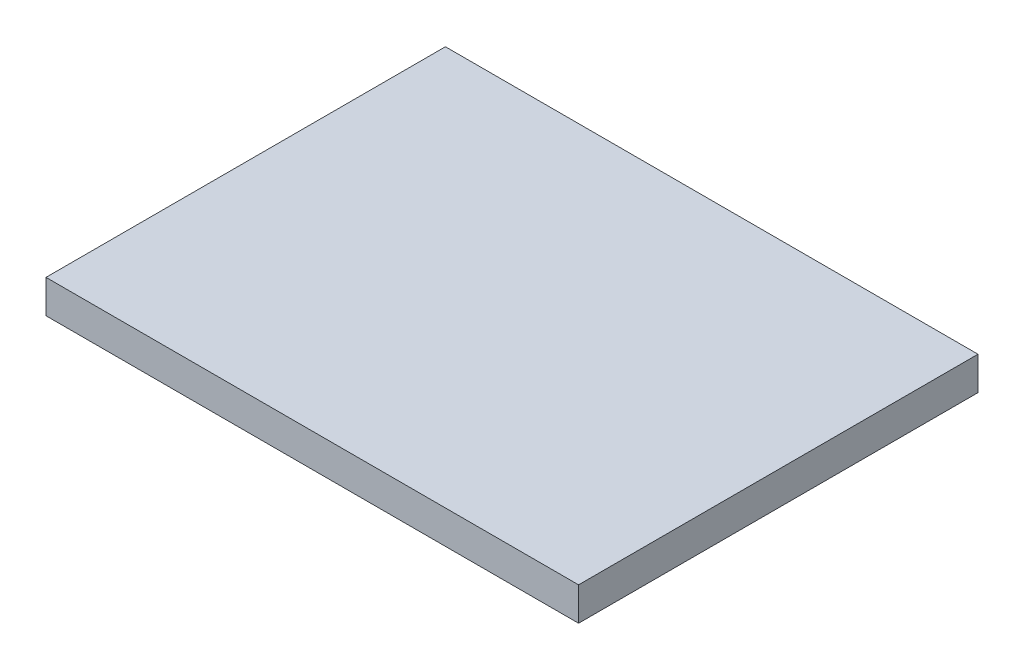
ISO-10303-21;
HEADER;
FILE_DESCRIPTION(('STEP AP214'),'2;1');
FILE_NAME('part.step','',(''),(''),'','','');
FILE_SCHEMA(('AUTOMOTIVE_DESIGN { 1 0 10303 214 1 1 1 1 }'));
ENDSEC;
DATA;
#1=APPLICATION_CONTEXT('core data for automotive mechanical design processes');
#2=APPLICATION_PROTOCOL_DEFINITION('international standard','automotive_design',2000,#1);
#3=PRODUCT_CONTEXT('',#1,'mechanical');
#4=PRODUCT('Part','Part','',(#3));
#5=PRODUCT_RELATED_PRODUCT_CATEGORY('part','',(#4));
#6=PRODUCT_DEFINITION_FORMATION('','',#4);
#7=PRODUCT_DEFINITION_CONTEXT('part definition',#1,'design');
#8=PRODUCT_DEFINITION('design','',#6,#7);
#9=PRODUCT_DEFINITION_SHAPE('','',#8);
#10=(LENGTH_UNIT() NAMED_UNIT(*) SI_UNIT(.MILLI.,.METRE.));
#11=(NAMED_UNIT(*) PLANE_ANGLE_UNIT() SI_UNIT($,.RADIAN.));
#12=(NAMED_UNIT(*) SI_UNIT($,.STERADIAN.) SOLID_ANGLE_UNIT());
#13=UNCERTAINTY_MEASURE_WITH_UNIT(LENGTH_MEASURE(1.E-05),#10,'distance_accuracy_value','');
#14=(GEOMETRIC_REPRESENTATION_CONTEXT(3) GLOBAL_UNCERTAINTY_ASSIGNED_CONTEXT((#13)) GLOBAL_UNIT_ASSIGNED_CONTEXT((#10,
#11,#12)) REPRESENTATION_CONTEXT('',''));
#15=CARTESIAN_POINT('',(0.,0.,0.));
#16=DIRECTION('',(0.,0.,1.));
#17=DIRECTION('',(1.,0.,0.));
#18=AXIS2_PLACEMENT_3D('',#15,#16,#17);
#19=CARTESIAN_POINT('',(-152.4,19.05,-152.4));
#20=DIRECTION('',(1.,0.,0.));
#21=DIRECTION('',(0.,0.,-1.));
#22=AXIS2_PLACEMENT_3D('',#19,#20,#21);
#23=PLANE('',#22);
#24=DIRECTION('',(0.,0.,1.));
#25=VECTOR('',#24,1.);
#26=CARTESIAN_POINT('',(-152.4,0.,-152.4));
#27=LINE('',#26,#25);
#28=CARTESIAN_POINT('',(-152.4,0.,-152.4));
#29=VERTEX_POINT('',#28);
#30=CARTESIAN_POINT('',(-152.4,0.,76.2));
#31=VERTEX_POINT('',#30);
#32=EDGE_CURVE('E95',#29,#31,#27,.T.);
#33=ORIENTED_EDGE('',*,*,#32,.T.);
#34=DIRECTION('',(0.,-1.,0.));
#35=VECTOR('',#34,1.);
#36=CARTESIAN_POINT('',(-152.4,19.05,76.2));
#37=LINE('',#36,#35);
#38=CARTESIAN_POINT('',(-152.4,19.05,76.2));
#39=VERTEX_POINT('',#38);
#40=EDGE_CURVE('E11',#39,#31,#37,.T.);
#41=ORIENTED_EDGE('',*,*,#40,.F.);
#42=DIRECTION('',(0.,0.,1.));
#43=VECTOR('',#42,1.);
#44=CARTESIAN_POINT('',(-152.4,19.05,-152.4));
#45=LINE('',#44,#43);
#46=CARTESIAN_POINT('',(-152.4,19.05,-152.4));
#47=VERTEX_POINT('',#46);
#48=EDGE_CURVE('E83',#47,#39,#45,.T.);
#49=ORIENTED_EDGE('',*,*,#48,.F.);
#50=DIRECTION('',(0.,-1.,0.));
#51=VECTOR('',#50,1.);
#52=CARTESIAN_POINT('',(-152.4,19.05,-152.4));
#53=LINE('',#52,#51);
#54=EDGE_CURVE('E91',#47,#29,#53,.T.);
#55=ORIENTED_EDGE('',*,*,#54,.T.);
#56=EDGE_LOOP('',(#33,#41,#49,#55));
#57=FACE_BOUND('',#56,.T.);
#58=ADVANCED_FACE('F32',(#57),#23,.F.);
#59=CARTESIAN_POINT('',(-152.4,19.05,76.2));
#60=DIRECTION('',(0.,0.,-1.));
#61=DIRECTION('',(-1.,0.,0.));
#62=AXIS2_PLACEMENT_3D('',#59,#60,#61);
#63=PLANE('',#62);
#64=DIRECTION('',(1.,0.,0.));
#65=VECTOR('',#64,1.);
#66=CARTESIAN_POINT('',(-152.4,0.,76.2));
#67=LINE('',#66,#65);
#68=CARTESIAN_POINT('',(152.4,0.,76.2));
#69=VERTEX_POINT('',#68);
#70=EDGE_CURVE('E87',#31,#69,#67,.T.);
#71=ORIENTED_EDGE('',*,*,#70,.T.);
#72=DIRECTION('',(0.,-1.,0.));
#73=VECTOR('',#72,1.);
#74=CARTESIAN_POINT('',(152.4,19.05,76.2));
#75=LINE('',#74,#73);
#76=CARTESIAN_POINT('',(152.4,19.05,76.2));
#77=VERTEX_POINT('',#76);
#78=EDGE_CURVE('E40',#77,#69,#75,.T.);
#79=ORIENTED_EDGE('',*,*,#78,.F.);
#80=DIRECTION('',(1.,0.,0.));
#81=VECTOR('',#80,1.);
#82=CARTESIAN_POINT('',(-152.4,19.05,76.2));
#83=LINE('',#82,#81);
#84=EDGE_CURVE('E78',#39,#77,#83,.T.);
#85=ORIENTED_EDGE('',*,*,#84,.F.);
#86=ORIENTED_EDGE('',*,*,#40,.T.);
#87=EDGE_LOOP('',(#71,#79,#85,#86));
#88=FACE_BOUND('',#87,.T.);
#89=ADVANCED_FACE('F86',(#88),#63,.F.);
#90=CARTESIAN_POINT('',(152.4,19.05,-152.4));
#91=DIRECTION('',(-1.,0.,0.));
#92=DIRECTION('',(0.,0.,1.));
#93=AXIS2_PLACEMENT_3D('',#90,#91,#92);
#94=PLANE('',#93);
#95=DIRECTION('',(0.,0.,-1.));
#96=VECTOR('',#95,1.);
#97=CARTESIAN_POINT('',(152.4,0.,-152.4));
#98=LINE('',#97,#96);
#99=CARTESIAN_POINT('',(152.4,0.,-152.4));
#100=VERTEX_POINT('',#99);
#101=EDGE_CURVE('E65',#69,#100,#98,.T.);
#102=ORIENTED_EDGE('',*,*,#101,.T.);
#103=DIRECTION('',(0.,-1.,0.));
#104=VECTOR('',#103,1.);
#105=CARTESIAN_POINT('',(152.4,19.05,-152.4));
#106=LINE('',#105,#104);
#107=CARTESIAN_POINT('',(152.4,19.05,-152.4));
#108=VERTEX_POINT('',#107);
#109=EDGE_CURVE('E88',#108,#100,#106,.T.);
#110=ORIENTED_EDGE('',*,*,#109,.F.);
#111=DIRECTION('',(0.,0.,-1.));
#112=VECTOR('',#111,1.);
#113=CARTESIAN_POINT('',(152.4,19.05,-152.4));
#114=LINE('',#113,#112);
#115=EDGE_CURVE('E81',#77,#108,#114,.T.);
#116=ORIENTED_EDGE('',*,*,#115,.F.);
#117=ORIENTED_EDGE('',*,*,#78,.T.);
#118=EDGE_LOOP('',(#102,#110,#116,#117));
#119=FACE_BOUND('',#118,.T.);
#120=ADVANCED_FACE('F89',(#119),#94,.F.);
#121=CARTESIAN_POINT('',(-152.4,19.05,-152.4));
#122=DIRECTION('',(0.,0.,1.));
#123=DIRECTION('',(1.,0.,0.));
#124=AXIS2_PLACEMENT_3D('',#121,#122,#123);
#125=PLANE('',#124);
#126=DIRECTION('',(-1.,0.,0.));
#127=VECTOR('',#126,1.);
#128=CARTESIAN_POINT('',(-152.4,0.,-152.4));
#129=LINE('',#128,#127);
#130=EDGE_CURVE('E71',#100,#29,#129,.T.);
#131=ORIENTED_EDGE('',*,*,#130,.T.);
#132=ORIENTED_EDGE('',*,*,#54,.F.);
#133=DIRECTION('',(-1.,0.,0.));
#134=VECTOR('',#133,1.);
#135=CARTESIAN_POINT('',(-152.4,19.05,-152.4));
#136=LINE('',#135,#134);
#137=EDGE_CURVE('E48',#108,#47,#136,.T.);
#138=ORIENTED_EDGE('',*,*,#137,.F.);
#139=ORIENTED_EDGE('',*,*,#109,.T.);
#140=EDGE_LOOP('',(#131,#132,#138,#139));
#141=FACE_BOUND('',#140,.T.);
#142=ADVANCED_FACE('F102',(#141),#125,.F.);
#143=CARTESIAN_POINT('',(0.,19.05,0.));
#144=DIRECTION('',(0.,1.,0.));
#145=DIRECTION('',(0.,0.,1.));
#146=AXIS2_PLACEMENT_3D('',#143,#144,#145);
#147=PLANE('',#146);
#148=ORIENTED_EDGE('',*,*,#48,.T.);
#149=ORIENTED_EDGE('',*,*,#84,.T.);
#150=ORIENTED_EDGE('',*,*,#115,.T.);
#151=ORIENTED_EDGE('',*,*,#137,.T.);
#152=EDGE_LOOP('',(#148,#149,#150,#151));
#153=FACE_BOUND('',#152,.T.);
#154=ADVANCED_FACE('F79',(#153),#147,.T.);
#155=CARTESIAN_POINT('',(0.,0.,0.));
#156=DIRECTION('',(0.,1.,0.));
#157=DIRECTION('',(0.,0.,1.));
#158=AXIS2_PLACEMENT_3D('',#155,#156,#157);
#159=PLANE('',#158);
#160=ORIENTED_EDGE('',*,*,#32,.F.);
#161=ORIENTED_EDGE('',*,*,#130,.F.);
#162=ORIENTED_EDGE('',*,*,#101,.F.);
#163=ORIENTED_EDGE('',*,*,#70,.F.);
#164=EDGE_LOOP('',(#160,#161,#162,#163));
#165=FACE_BOUND('',#164,.T.);
#166=ADVANCED_FACE('F105',(#165),#159,.F.);
#167=CLOSED_SHELL('',(#58,#89,#120,#142,#154,#166));
#168=MANIFOLD_SOLID_BREP('B2',#167);
#169=ADVANCED_BREP_SHAPE_REPRESENTATION('',(#18,#168),#14);
#170=SHAPE_DEFINITION_REPRESENTATION(#9,#169);
ENDSEC;
END-ISO-10303-21;
